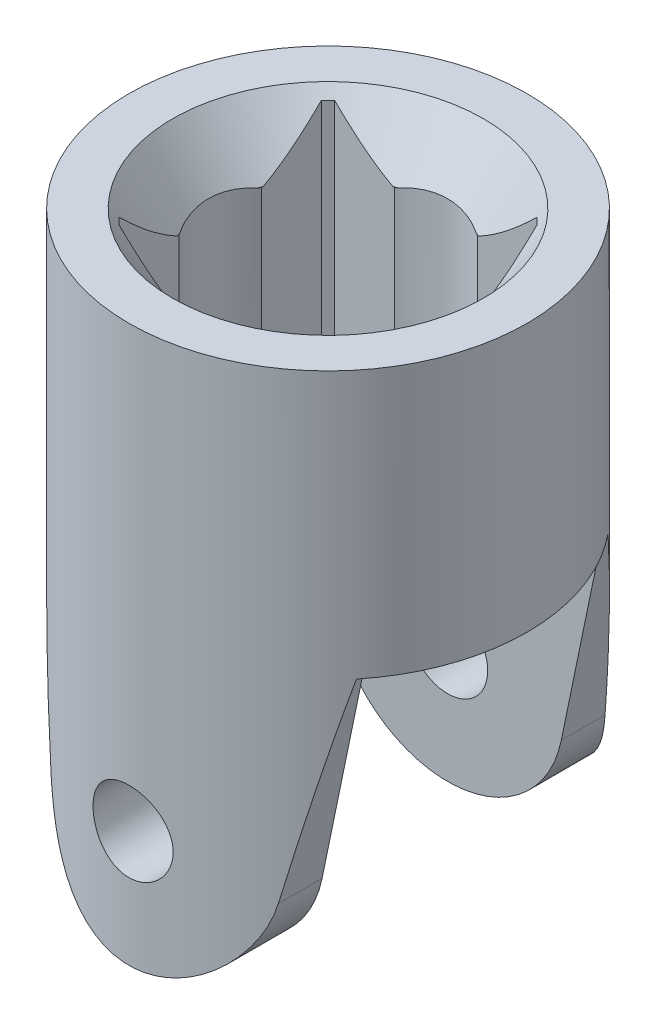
from build123d import *

# Parameters (mm, degrees)
SKETCH1_R           = 12
BOSS_EXTRUDE1_DEPTH = 33.53
CUT_EXTRUDE1_DEPTH  = 19.6
CHAMFER1_SIZE       = 0.4
SKETCH3_R           = 9.375
CUT_EXTRUDE2_DEPTH  = 3.4
CUT_EXTRUDE2_DRAFT  = -35
SKETCH4_W           = 24
SKETCH4_H           = 14.42225279
CUT_EXTRUDE3_DEPTH  = 17.4
SKETCH5_R           = 2.415
CUT_EXTRUDE4_DEPTH  = 33.7


with BuildPart() as part:
    # Sketch1 → Boss-Extrude1 (new body)
    with BuildSketch(Plane(origin=(0, 0, 0), x_dir=(1, 0, 0), z_dir=(0, 1, 0))):
        with Locations(Location((0, 0, 0), (0, 0, 270))):
            Circle(SKETCH1_R)
    extrude(amount=BOSS_EXTRUDE1_DEPTH)

    # Sketch2 → Cut-Extrude1 (cut)
    with BuildSketch(Plane(origin=(0, 33.53, 0), x_dir=(1, 0, 0), z_dir=(0, 1, 0))):
        with BuildLine():
            Line((-6.5, 6.5), (-2.5, 6.5))
            ThreePointArc((-2.5, 6.5), (0, 7.211126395), (2.5, 6.5))
            Line((2.5, 6.5), (6.5, 6.5))
            Line((6.5, 6.5), (6.5, 2.5))
            ThreePointArc((6.5, 2.5), (7.211126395, 0), (6.5, -2.5))
            Line((6.5, -2.5), (6.5, -6.5))
            Line((6.5, -6.5), (2.5, -6.5))
            ThreePointArc((2.5, -6.5), (0, -7.211126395), (-2.5, -6.5))
            Line((-2.5, -6.5), (-6.5, -6.5))
            Line((-6.5, -6.5), (-6.5, -2.5))
            ThreePointArc((-6.5, -2.5), (-7.211126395, 0), (-6.5, 2.5))
            Line((-6.5, 2.5), (-6.5, 6.5))
        make_face()
    extrude(amount=-CUT_EXTRUDE1_DEPTH, mode=Mode.SUBTRACT)

    # Chamfer1
    chamfer1_edges = [part.edges().sort_by_distance(p)[0] for p in [
        (-6.5, 23.73, -6.5),
        (6.5, 23.73, -6.5),
        (6.5, 23.73, 6.5),
        (-6.5, 23.73, 6.5),
    ]]
    chamfer(chamfer1_edges, length=CHAMFER1_SIZE)


with BuildPart() as cut_extrude2_tool:
    # Sketch3 → Cut-Extrude2 (with draft: the straight prism first)
    with BuildSketch(Plane(origin=(0, 33.53, 0), x_dir=(1, 0, 0), z_dir=(0, 1, 0))):
        Circle(SKETCH3_R)
    extrude(amount=-CUT_EXTRUDE2_DEPTH)
    # Cut-Extrude2: the draft: its side faces are tilted about the plane it starts from
    cut_extrude2_sides = [cut_extrude2_tool.faces().sort_by_distance(p)[0] for p in [
        (-9.375, 31.83, 0),
    ]]
    draft(cut_extrude2_sides, Plane(origin=(0, 33.53, 0), x_dir=(1, 0, 0), z_dir=(0, 1, 0)), CUT_EXTRUDE2_DRAFT)


with BuildPart() as part_1:
    add(part.part)

    # Cut-Extrude2: cut by cut_extrude2_tool
    add(cut_extrude2_tool.part, mode=Mode.SUBTRACT)

    # Sketch4 → Cut-Extrude3 (cut)
    with BuildSketch(Plane.XZ):
        Rectangle(SKETCH4_W, SKETCH4_H)
    extrude(amount=-CUT_EXTRUDE3_DEPTH, mode=Mode.SUBTRACT)

    # Sketch5 → Cut-Extrude4 (cut, symmetric)
    with BuildSketch(Plane.XY):
        with Locations(Location((0, 7, 0), (0, 0, 90))):
            Circle(SKETCH5_R)
        with BuildLine():
            ThreePointArc((-6.854820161, 5.581747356), (0, 0), (6.854820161, 5.581747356))
            Line((6.854820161, 5.581747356), (9.3, 17.4))
            Line((9.3, 17.4), (12, 17.4))
            Line((12, 17.4), (12, -3.192277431))
            Line((12, -3.192277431), (-12, -3.192277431))
            Line((-12, -3.192277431), (-12, 17.4))
            Line((-12, 17.4), (-9.3, 17.4))
            Line((-9.3, 17.4), (-6.854820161, 5.581747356))
        make_face()
    extrude(amount=CUT_EXTRUDE4_DEPTH, both=True, mode=Mode.SUBTRACT)


solid = part_1.part
